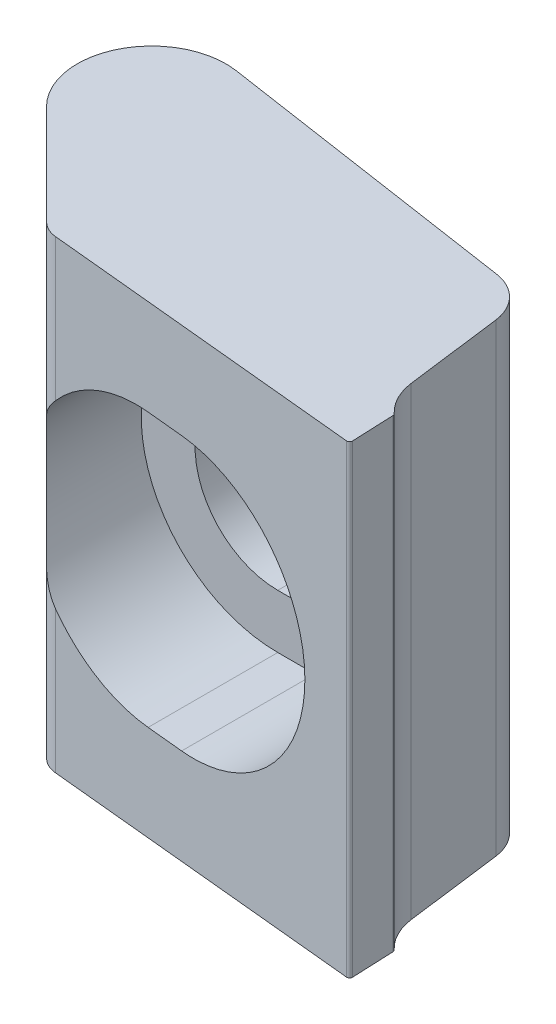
ISO-10303-21;
HEADER;
FILE_DESCRIPTION(('STEP AP214'),'2;1');
FILE_NAME('part.step','',(''),(''),'','','');
FILE_SCHEMA(('AUTOMOTIVE_DESIGN { 1 0 10303 214 1 1 1 1 }'));
ENDSEC;
DATA;
#1=APPLICATION_CONTEXT('core data for automotive mechanical design processes');
#2=APPLICATION_PROTOCOL_DEFINITION('international standard','automotive_design',2000,#1);
#3=PRODUCT_CONTEXT('',#1,'mechanical');
#4=PRODUCT('Part','Part','',(#3));
#5=PRODUCT_RELATED_PRODUCT_CATEGORY('part','',(#4));
#6=PRODUCT_DEFINITION_FORMATION('','',#4);
#7=PRODUCT_DEFINITION_CONTEXT('part definition',#1,'design');
#8=PRODUCT_DEFINITION('design','',#6,#7);
#9=PRODUCT_DEFINITION_SHAPE('','',#8);
#10=(LENGTH_UNIT() NAMED_UNIT(*) SI_UNIT(.MILLI.,.METRE.));
#11=(NAMED_UNIT(*) PLANE_ANGLE_UNIT() SI_UNIT($,.RADIAN.));
#12=(NAMED_UNIT(*) SI_UNIT($,.STERADIAN.) SOLID_ANGLE_UNIT());
#13=UNCERTAINTY_MEASURE_WITH_UNIT(LENGTH_MEASURE(1.E-05),#10,'distance_accuracy_value','');
#14=(GEOMETRIC_REPRESENTATION_CONTEXT(3) GLOBAL_UNCERTAINTY_ASSIGNED_CONTEXT((#13)) GLOBAL_UNIT_ASSIGNED_CONTEXT((#10,
#11,#12)) REPRESENTATION_CONTEXT('',''));
#15=CARTESIAN_POINT('',(0.,0.,0.));
#16=DIRECTION('',(0.,0.,1.));
#17=DIRECTION('',(1.,0.,0.));
#18=AXIS2_PLACEMENT_3D('',#15,#16,#17);
#19=CARTESIAN_POINT('',(-3.74531324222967,6.35,5.6642));
#20=DIRECTION('',(0.,-1.,0.));
#21=DIRECTION('',(1.,0.,0.));
#22=AXIS2_PLACEMENT_3D('',#19,#20,#21);
#23=CYLINDRICAL_SURFACE('',#22,0.762);
#24=DIRECTION('',(0.,-1.,0.));
#25=VECTOR('',#24,1.);
#26=CARTESIAN_POINT('',(-4.28385165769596,6.35,6.20329217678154));
#27=LINE('',#26,#25);
#28=CARTESIAN_POINT('',(-4.28385165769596,6.35,6.20329217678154));
#29=VERTEX_POINT('',#28);
#30=CARTESIAN_POINT('',(-4.28385165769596,1.80621371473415,6.20329217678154));
#31=VERTEX_POINT('',#30);
#32=EDGE_CURVE('E314',#29,#31,#27,.T.);
#33=ORIENTED_EDGE('',*,*,#32,.T.);
#34=CARTESIAN_POINT('',(-4.28385165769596,1.80621371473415,6.20329217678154));
#35=CARTESIAN_POINT('',(-4.25857898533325,1.85195880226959,6.22847677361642));
#36=CARTESIAN_POINT('',(-4.23186668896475,1.89799930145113,6.25167891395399));
#37=CARTESIAN_POINT('',(-4.17557276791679,1.99029356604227,6.29410764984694));
#38=CARTESIAN_POINT('',(-4.14598590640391,2.0365475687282,6.31332678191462));
#39=CARTESIAN_POINT('',(-4.08466603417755,2.12779689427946,6.34734160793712));
#40=CARTESIAN_POINT('',(-4.05298773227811,2.17279889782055,6.36221802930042));
#41=CARTESIAN_POINT('',(-3.98707838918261,2.26208455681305,6.38769246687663));
#42=CARTESIAN_POINT('',(-3.95285034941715,2.3063689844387,6.39829542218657));
#43=CARTESIAN_POINT('',(-3.90155545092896,2.36969807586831,6.41018736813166));
#44=CARTESIAN_POINT('',(-3.88544920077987,2.38917667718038,6.41338642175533));
#45=CARTESIAN_POINT('',(-3.85270020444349,2.42797068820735,6.41877832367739));
#46=CARTESIAN_POINT('',(-3.83605537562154,2.44728497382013,6.42096659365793));
#47=CARTESIAN_POINT('',(-3.81918632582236,2.46645674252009,6.42261068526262));
#48=B_SPLINE_CURVE_WITH_KNOTS('',3,(#34,#35,#36,#37,#38,#39,#40,#41,#42,#43,#44,#45,#46,#47),
.UNSPECIFIED.,.F.,.F.,(4,2,2,2,2,2,4),(0.,0.173988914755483,0.348300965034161,0.519129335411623,
0.689759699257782,0.766167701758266,0.84291847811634),.UNSPECIFIED.);
#49=CARTESIAN_POINT('',(-3.81918632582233,2.46645674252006,6.42261068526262));
#50=VERTEX_POINT('',#49);
#51=EDGE_CURVE('E212',#31,#50,#48,.T.);
#52=ORIENTED_EDGE('',*,*,#51,.T.);
#53=DIRECTION('',(0.,-1.,0.));
#54=VECTOR('',#53,1.);
#55=CARTESIAN_POINT('',(-3.81918632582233,6.35,6.42261068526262));
#56=LINE('',#55,#54);
#57=CARTESIAN_POINT('',(-3.81918632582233,6.35,6.42261068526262));
#58=VERTEX_POINT('',#57);
#59=EDGE_CURVE('E310',#58,#50,#56,.T.);
#60=ORIENTED_EDGE('',*,*,#59,.F.);
#61=CARTESIAN_POINT('',(-3.74531324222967,6.35,5.6642));
#62=DIRECTION('',(0.,1.,0.));
#63=DIRECTION('',(-1.,0.,0.));
#64=AXIS2_PLACEMENT_3D('',#61,#62,#63);
#65=CIRCLE('',#64,0.762);
#66=EDGE_CURVE('E292',#29,#58,#65,.T.);
#67=ORIENTED_EDGE('',*,*,#66,.F.);
#68=EDGE_LOOP('',(#33,#52,#60,#67));
#69=FACE_BOUND('',#68,.T.);
#70=ADVANCED_FACE('F14',(#69),#23,.T.);
#71=CARTESIAN_POINT('',(4.95448975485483,6.35,6.04505085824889));
#72=DIRECTION('',(0.,-1.,0.));
#73=DIRECTION('',(1.,0.,0.));
#74=AXIS2_PLACEMENT_3D('',#71,#72,#73);
#75=CYLINDRICAL_SURFACE('',#74,0.0762);
#76=CARTESIAN_POINT('',(4.95448975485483,-6.35,6.04505085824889));
#77=DIRECTION('',(0.,1.,0.));
#78=DIRECTION('',(-1.,0.,0.));
#79=AXIS2_PLACEMENT_3D('',#76,#77,#78);
#80=CIRCLE('',#79,0.0762);
#81=CARTESIAN_POINT('',(5.03062085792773,-6.35,6.0418112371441));
#82=VERTEX_POINT('',#81);
#83=CARTESIAN_POINT('',(5.00659435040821,-6.35,5.98944913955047));
#84=VERTEX_POINT('',#83);
#85=EDGE_CURVE('E252',#82,#84,#80,.T.);
#86=ORIENTED_EDGE('',*,*,#85,.T.);
#87=DIRECTION('',(0.,-1.,0.));
#88=VECTOR('',#87,1.);
#89=CARTESIAN_POINT('',(5.00659435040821,6.35,5.98944913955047));
#90=LINE('',#89,#88);
#91=CARTESIAN_POINT('',(5.00659435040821,6.35,5.98944913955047));
#92=VERTEX_POINT('',#91);
#93=EDGE_CURVE('E332',#92,#84,#90,.T.);
#94=ORIENTED_EDGE('',*,*,#93,.F.);
#95=CARTESIAN_POINT('',(4.95448975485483,6.35,6.04505085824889));
#96=DIRECTION('',(0.,1.,0.));
#97=DIRECTION('',(-1.,0.,0.));
#98=AXIS2_PLACEMENT_3D('',#95,#96,#97);
#99=CIRCLE('',#98,0.0762);
#100=CARTESIAN_POINT('',(5.03062085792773,6.35,6.0418112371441));
#101=VERTEX_POINT('',#100);
#102=EDGE_CURVE('E277',#101,#92,#99,.T.);
#103=ORIENTED_EDGE('',*,*,#102,.F.);
#104=DIRECTION('',(0.,-1.,0.));
#105=VECTOR('',#104,1.);
#106=CARTESIAN_POINT('',(5.03062085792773,6.35,6.0418112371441));
#107=LINE('',#106,#105);
#108=EDGE_CURVE('E300',#101,#82,#107,.T.);
#109=ORIENTED_EDGE('',*,*,#108,.T.);
#110=EDGE_LOOP('',(#86,#94,#103,#109));
#111=FACE_BOUND('',#110,.T.);
#112=ADVANCED_FACE('F16',(#111),#75,.T.);
#113=CARTESIAN_POINT('',(6.09210675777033,6.35,4.83108));
#114=DIRECTION('',(0.,-1.,0.));
#115=DIRECTION('',(1.,0.,0.));
#116=AXIS2_PLACEMENT_3D('',#113,#114,#115);
#117=CYLINDRICAL_SURFACE('',#116,1.5875);
#118=CARTESIAN_POINT('',(6.09210675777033,-6.35,4.83108));
#119=DIRECTION('',(0.,-1.,0.));
#120=DIRECTION('',(-1.,0.,0.));
#121=AXIS2_PLACEMENT_3D('',#118,#119,#120);
#122=CIRCLE('',#121,1.5875);
#123=CARTESIAN_POINT('',(4.51768942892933,-6.35,5.03446712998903));
#124=VERTEX_POINT('',#123);
#125=EDGE_CURVE('E255',#84,#124,#122,.T.);
#126=ORIENTED_EDGE('',*,*,#125,.T.);
#127=DIRECTION('',(0.,-1.,0.));
#128=VECTOR('',#127,1.);
#129=CARTESIAN_POINT('',(4.51768942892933,6.35,5.03446712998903));
#130=LINE('',#129,#128);
#131=CARTESIAN_POINT('',(4.51768942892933,6.35,5.03446712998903));
#132=VERTEX_POINT('',#131);
#133=EDGE_CURVE('E329',#132,#124,#130,.T.);
#134=ORIENTED_EDGE('',*,*,#133,.F.);
#135=CARTESIAN_POINT('',(6.09210675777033,6.35,4.83108));
#136=DIRECTION('',(0.,-1.,0.));
#137=DIRECTION('',(-1.,0.,0.));
#138=AXIS2_PLACEMENT_3D('',#135,#136,#137);
#139=CIRCLE('',#138,1.5875);
#140=EDGE_CURVE('E280',#92,#132,#139,.T.);
#141=ORIENTED_EDGE('',*,*,#140,.F.);
#142=ORIENTED_EDGE('',*,*,#93,.T.);
#143=EDGE_LOOP('',(#126,#134,#141,#142));
#144=FACE_BOUND('',#143,.T.);
#145=ADVANCED_FACE('F403',(#144),#117,.F.);
#146=CARTESIAN_POINT('',(4.51768942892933,6.35,5.03446712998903));
#147=DIRECTION('',(-0.991758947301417,0.,0.128117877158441));
#148=DIRECTION('',(0.128117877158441,0.,0.991758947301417));
#149=AXIS2_PLACEMENT_3D('',#146,#147,#148);
#150=PLANE('',#149);
#151=DIRECTION('',(-0.128117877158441,0.,-0.991758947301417));
#152=VECTOR('',#151,1.);
#153=CARTESIAN_POINT('',(4.51768942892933,-6.35,5.03446712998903));
#154=LINE('',#153,#152);
#155=CARTESIAN_POINT('',(4.17410062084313,-6.35,2.37475029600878));
#156=VERTEX_POINT('',#155);
#157=EDGE_CURVE('E257',#124,#156,#154,.T.);
#158=ORIENTED_EDGE('',*,*,#157,.T.);
#159=DIRECTION('',(0.,-1.,0.));
#160=VECTOR('',#159,1.);
#161=CARTESIAN_POINT('',(4.17410062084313,6.35,2.37475029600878));
#162=LINE('',#161,#160);
#163=CARTESIAN_POINT('',(4.17410062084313,6.35,2.37475029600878));
#164=VERTEX_POINT('',#163);
#165=EDGE_CURVE('E326',#164,#156,#162,.T.);
#166=ORIENTED_EDGE('',*,*,#165,.F.);
#167=DIRECTION('',(-0.128117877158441,0.,-0.991758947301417));
#168=VECTOR('',#167,1.);
#169=CARTESIAN_POINT('',(4.51768942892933,6.35,5.03446712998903));
#170=LINE('',#169,#168);
#171=EDGE_CURVE('E282',#132,#164,#170,.T.);
#172=ORIENTED_EDGE('',*,*,#171,.F.);
#173=ORIENTED_EDGE('',*,*,#133,.T.);
#174=EDGE_LOOP('',(#158,#166,#172,#173));
#175=FACE_BOUND('',#174,.T.);
#176=ADVANCED_FACE('F399',(#175),#150,.F.);
#177=CARTESIAN_POINT('',(2.91456675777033,6.35,2.53746));
#178=DIRECTION('',(0.,-1.,0.));
#179=DIRECTION('',(1.,0.,0.));
#180=AXIS2_PLACEMENT_3D('',#177,#178,#179);
#181=CYLINDRICAL_SURFACE('',#180,1.27);
#182=CARTESIAN_POINT('',(2.91456675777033,-6.35,2.53746));
#183=DIRECTION('',(0.,1.,0.));
#184=DIRECTION('',(-1.,0.,0.));
#185=AXIS2_PLACEMENT_3D('',#182,#183,#184);
#186=CIRCLE('',#185,1.27);
#187=CARTESIAN_POINT('',(3.10312886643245,-6.35,1.28153630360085));
#188=VERTEX_POINT('',#187);
#189=EDGE_CURVE('E259',#156,#188,#186,.T.);
#190=ORIENTED_EDGE('',*,*,#189,.T.);
#191=DIRECTION('',(0.,-1.,0.));
#192=VECTOR('',#191,1.);
#193=CARTESIAN_POINT('',(3.10312886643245,6.35,1.28153630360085));
#194=LINE('',#193,#192);
#195=CARTESIAN_POINT('',(3.10312886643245,6.35,1.28153630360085));
#196=VERTEX_POINT('',#195);
#197=EDGE_CURVE('E323',#196,#188,#194,.T.);
#198=ORIENTED_EDGE('',*,*,#197,.F.);
#199=CARTESIAN_POINT('',(2.91456675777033,6.35,2.53746));
#200=DIRECTION('',(0.,1.,0.));
#201=DIRECTION('',(-1.,0.,0.));
#202=AXIS2_PLACEMENT_3D('',#199,#200,#201);
#203=CIRCLE('',#202,1.27);
#204=EDGE_CURVE('E284',#164,#196,#203,.T.);
#205=ORIENTED_EDGE('',*,*,#204,.F.);
#206=ORIENTED_EDGE('',*,*,#165,.T.);
#207=EDGE_LOOP('',(#190,#198,#205,#206));
#208=FACE_BOUND('',#207,.T.);
#209=ADVANCED_FACE('F395',(#208),#181,.T.);
#210=CARTESIAN_POINT('',(-5.28257386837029,6.35,0.0225220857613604));
#211=DIRECTION('',(-0.14847410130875,0.,0.988916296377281));
#212=DIRECTION('',(0.988916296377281,0.,0.14847410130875));
#213=AXIS2_PLACEMENT_3D('',#210,#211,#212);
#214=PLANE('',#213);
#215=DIRECTION('',(-0.988916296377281,0.,-0.14847410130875));
#216=VECTOR('',#215,1.);
#217=CARTESIAN_POINT('',(-5.28257386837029,2.2606,0.0225220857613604));
#218=LINE('',#217,#216);
#219=CARTESIAN_POINT('',(0.,2.2606,0.81563815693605));
#220=VERTEX_POINT('',#219);
#221=CARTESIAN_POINT('',(-1.016,2.2606,0.663097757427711));
#222=VERTEX_POINT('',#221);
#223=EDGE_CURVE('E190',#220,#222,#218,.T.);
#224=ORIENTED_EDGE('',*,*,#223,.T.);
#225=CARTESIAN_POINT('',(-1.016,0.,0.663097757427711));
#226=DIRECTION('',(-0.14847410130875,0.,0.988916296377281));
#227=DIRECTION('',(0.988916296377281,0.,0.14847410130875));
#228=AXIS2_PLACEMENT_3D('',#225,#226,#227);
#229=ELLIPSE('',#228,2.28593664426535,2.2606);
#230=CARTESIAN_POINT('',(-1.016,-2.2606,0.663097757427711));
#231=VERTEX_POINT('',#230);
#232=EDGE_CURVE('E193',#222,#231,#229,.T.);
#233=ORIENTED_EDGE('',*,*,#232,.T.);
#234=DIRECTION('',(0.988916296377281,0.,0.14847410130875));
#235=VECTOR('',#234,1.);
#236=CARTESIAN_POINT('',(-5.28257386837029,-2.2606,0.0225220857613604));
#237=LINE('',#236,#235);
#238=CARTESIAN_POINT('',(0.,-2.2606,0.81563815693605));
#239=VERTEX_POINT('',#238);
#240=EDGE_CURVE('E185',#231,#239,#237,.T.);
#241=ORIENTED_EDGE('',*,*,#240,.T.);
#242=CARTESIAN_POINT('',(0.,0.,0.81563815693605));
#243=DIRECTION('',(-0.14847410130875,0.,0.988916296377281));
#244=DIRECTION('',(0.988916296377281,0.,0.14847410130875));
#245=AXIS2_PLACEMENT_3D('',#242,#243,#244);
#246=ELLIPSE('',#245,2.28593664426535,2.2606);
#247=EDGE_CURVE('E165',#239,#220,#246,.T.);
#248=ORIENTED_EDGE('',*,*,#247,.T.);
#249=EDGE_LOOP('',(#224,#233,#241,#248));
#250=FACE_BOUND('',#249,.T.);
#251=DIRECTION('',(-0.988916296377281,0.,-0.14847410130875));
#252=VECTOR('',#251,1.);
#253=CARTESIAN_POINT('',(-5.28257386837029,-6.35,0.0225220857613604));
#254=LINE('',#253,#252);
#255=CARTESIAN_POINT('',(-5.28257386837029,-6.35,0.0225220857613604));
#256=VERTEX_POINT('',#255);
#257=EDGE_CURVE('E261',#188,#256,#254,.T.);
#258=ORIENTED_EDGE('',*,*,#257,.T.);
#259=DIRECTION('',(0.,-1.,0.));
#260=VECTOR('',#259,1.);
#261=CARTESIAN_POINT('',(-5.28257386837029,6.35,0.0225220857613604));
#262=LINE('',#261,#260);
#263=CARTESIAN_POINT('',(-5.28257386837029,6.35,0.0225220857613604));
#264=VERTEX_POINT('',#263);
#265=EDGE_CURVE('E320',#264,#256,#262,.T.);
#266=ORIENTED_EDGE('',*,*,#265,.F.);
#267=DIRECTION('',(-0.988916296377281,0.,-0.14847410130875));
#268=VECTOR('',#267,1.);
#269=CARTESIAN_POINT('',(-5.28257386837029,6.35,0.0225220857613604));
#270=LINE('',#269,#268);
#271=EDGE_CURVE('E286',#196,#264,#270,.T.);
#272=ORIENTED_EDGE('',*,*,#271,.F.);
#273=ORIENTED_EDGE('',*,*,#197,.T.);
#274=EDGE_LOOP('',(#258,#266,#272,#273));
#275=FACE_BOUND('',#274,.T.);
#276=ADVANCED_FACE('F391',(#250,#275),#214,.F.);
#277=CARTESIAN_POINT('',(-5.58427324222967,6.35,2.032));
#278=DIRECTION('',(0.,-1.,0.));
#279=DIRECTION('',(1.,0.,0.));
#280=AXIS2_PLACEMENT_3D('',#277,#278,#279);
#281=CYLINDRICAL_SURFACE('',#280,2.032);
#282=CARTESIAN_POINT('',(-5.58427324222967,-6.35,2.032));
#283=DIRECTION('',(0.,1.,0.));
#284=DIRECTION('',(-1.,0.,0.));
#285=AXIS2_PLACEMENT_3D('',#282,#283,#284);
#286=CIRCLE('',#285,2.032);
#287=CARTESIAN_POINT('',(-7.02037568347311,-6.35,3.46957913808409));
#288=VERTEX_POINT('',#287);
#289=EDGE_CURVE('E263',#256,#288,#286,.T.);
#290=ORIENTED_EDGE('',*,*,#289,.T.);
#291=DIRECTION('',(0.,-1.,0.));
#292=VECTOR('',#291,1.);
#293=CARTESIAN_POINT('',(-7.02037568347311,6.35,3.46957913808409));
#294=LINE('',#293,#292);
#295=CARTESIAN_POINT('',(-7.02037568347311,6.35,3.46957913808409));
#296=VERTEX_POINT('',#295);
#297=EDGE_CURVE('E317',#296,#288,#294,.T.);
#298=ORIENTED_EDGE('',*,*,#297,.F.);
#299=CARTESIAN_POINT('',(-5.58427324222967,6.35,2.032));
#300=DIRECTION('',(0.,1.,0.));
#301=DIRECTION('',(-1.,0.,0.));
#302=AXIS2_PLACEMENT_3D('',#299,#300,#301);
#303=CIRCLE('',#302,2.032);
#304=EDGE_CURVE('E288',#264,#296,#303,.T.);
#305=ORIENTED_EDGE('',*,*,#304,.F.);
#306=ORIENTED_EDGE('',*,*,#265,.T.);
#307=EDGE_LOOP('',(#290,#298,#305,#306));
#308=FACE_BOUND('',#307,.T.);
#309=ADVANCED_FACE('F386',(#308),#281,.T.);
#310=CARTESIAN_POINT('',(-4.28385165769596,6.35,6.20329217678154));
#311=DIRECTION('',(0.706743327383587,0.,-0.707470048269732));
#312=DIRECTION('',(-0.707470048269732,0.,-0.706743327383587));
#313=AXIS2_PLACEMENT_3D('',#310,#311,#312);
#314=PLANE('',#313);
#315=CARTESIAN_POINT('',(-4.28385165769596,-1.80621371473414,6.20329217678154));
#316=VERTEX_POINT('',#315);
#317=CARTESIAN_POINT('',(-4.28385165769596,-6.35,6.20329217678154));
#318=VERTEX_POINT('',#317);
#319=EDGE_CURVE('E313',#316,#318,#27,.T.);
#320=ORIENTED_EDGE('',*,*,#319,.F.);
#321=CARTESIAN_POINT('',(-1.016,0.,9.46778706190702));
#322=DIRECTION('',(0.706743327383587,0.,-0.707470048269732));
#323=DIRECTION('',(0.707470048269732,0.,0.706743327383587));
#324=AXIS2_PLACEMENT_3D('',#321,#322,#323);
#325=ELLIPSE('',#324,5.27767925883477,3.7338);
#326=EDGE_CURVE('E228',#316,#31,#325,.T.);
#327=ORIENTED_EDGE('',*,*,#326,.T.);
#328=ORIENTED_EDGE('',*,*,#32,.F.);
#329=DIRECTION('',(0.707470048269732,0.,0.706743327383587));
#330=VECTOR('',#329,1.);
#331=CARTESIAN_POINT('',(-4.28385165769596,6.35,6.20329217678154));
#332=LINE('',#331,#330);
#333=EDGE_CURVE('E290',#296,#29,#332,.T.);
#334=ORIENTED_EDGE('',*,*,#333,.F.);
#335=ORIENTED_EDGE('',*,*,#297,.T.);
#336=DIRECTION('',(0.707470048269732,0.,0.706743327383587));
#337=VECTOR('',#336,1.);
#338=CARTESIAN_POINT('',(-4.28385165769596,-6.35,6.20329217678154));
#339=LINE('',#338,#337);
#340=EDGE_CURVE('E265',#288,#318,#339,.T.);
#341=ORIENTED_EDGE('',*,*,#340,.T.);
#342=EDGE_LOOP('',(#320,#327,#328,#334,#335,#341));
#343=FACE_BOUND('',#342,.T.);
#344=ADVANCED_FACE('F356',(#343),#314,.F.);
#345=CARTESIAN_POINT('',(-3.81918632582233,-2.46645674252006,6.42261068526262));
#346=VERTEX_POINT('',#345);
#347=CARTESIAN_POINT('',(-3.81918632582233,-6.35,6.42261068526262));
#348=VERTEX_POINT('',#347);
#349=EDGE_CURVE('E309',#346,#348,#56,.T.);
#350=ORIENTED_EDGE('',*,*,#349,.F.);
#351=CARTESIAN_POINT('',(-3.81918632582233,-2.46645674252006,6.42261068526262));
#352=CARTESIAN_POINT('',(-3.85286461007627,-2.42819103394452,6.41931082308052));
#353=CARTESIAN_POINT('',(-3.88563489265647,-2.38935655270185,6.41387476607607));
#354=CARTESIAN_POINT('',(-3.94921411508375,-2.31085548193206,6.39914196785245));
#355=CARTESIAN_POINT('',(-3.9800241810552,-2.27118938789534,6.38984746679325));
#356=CARTESIAN_POINT('',(-4.03910741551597,-2.19191552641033,6.36797851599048));
#357=CARTESIAN_POINT('',(-4.06741292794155,-2.15231670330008,6.35545810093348));
#358=CARTESIAN_POINT('',(-4.12196567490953,-2.07281507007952,6.3273131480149));
#359=CARTESIAN_POINT('',(-4.14821319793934,-2.03291230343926,6.31168904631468));
#360=CARTESIAN_POINT('',(-4.19305079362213,-1.96187761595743,6.28124106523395));
#361=CARTESIAN_POINT('',(-4.21205257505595,-1.93075315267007,6.26700131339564));
#362=CARTESIAN_POINT('',(-4.24887982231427,-1.86844124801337,6.23659331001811));
#363=CARTESIAN_POINT('',(-4.26669716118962,-1.83725463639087,6.22041352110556));
#364=CARTESIAN_POINT('',(-4.28385165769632,-1.80621371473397,6.20329217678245));
#365=B_SPLINE_CURVE_WITH_KNOTS('',3,(#351,#352,#353,#354,#355,#356,#357,#358,#359,#360,#361,
#362,#363,#364),.UNSPECIFIED.,.F.,.F.,(4,2,2,2,2,2,4),(0.,0.153140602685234,0.306192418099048,
0.456830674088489,0.607447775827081,0.724830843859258,0.842950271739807),.UNSPECIFIED.);
#366=EDGE_CURVE('E245',#346,#316,#365,.T.);
#367=ORIENTED_EDGE('',*,*,#366,.T.);
#368=ORIENTED_EDGE('',*,*,#319,.T.);
#369=CARTESIAN_POINT('',(-3.74531324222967,-6.35,5.6642));
#370=DIRECTION('',(0.,1.,0.));
#371=DIRECTION('',(-1.,0.,0.));
#372=AXIS2_PLACEMENT_3D('',#369,#370,#371);
#373=CIRCLE('',#372,0.762);
#374=EDGE_CURVE('E268',#318,#348,#373,.T.);
#375=ORIENTED_EDGE('',*,*,#374,.T.);
#376=EDGE_LOOP('',(#350,#367,#368,#375));
#377=FACE_BOUND('',#376,.T.);
#378=ADVANCED_FACE('F230',(#377),#23,.T.);
#379=CARTESIAN_POINT('',(4.99648158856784,6.35,7.2813018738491));
#380=DIRECTION('',(0.0969463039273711,0.,-0.995289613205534));
#381=DIRECTION('',(-0.995289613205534,0.,-0.0969463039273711));
#382=AXIS2_PLACEMENT_3D('',#379,#380,#381);
#383=PLANE('',#382);
#384=DIRECTION('',(-0.995289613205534,0.,-0.0969463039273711));
#385=VECTOR('',#384,1.);
#386=CARTESIAN_POINT('',(4.99648158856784,-3.7338,7.2813018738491));
#387=LINE('',#386,#385);
#388=CARTESIAN_POINT('',(0.,-3.7338,6.79461898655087));
#389=VERTEX_POINT('',#388);
#390=CARTESIAN_POINT('',(-1.016,-3.7338,6.6956553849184));
#391=VERTEX_POINT('',#390);
#392=EDGE_CURVE('E18',#389,#391,#387,.T.);
#393=ORIENTED_EDGE('',*,*,#392,.T.);
#394=CARTESIAN_POINT('',(-1.016,0.,6.6956553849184));
#395=DIRECTION('',(0.0969463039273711,0.,-0.995289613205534));
#396=DIRECTION('',(0.995289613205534,0.,0.0969463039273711));
#397=AXIS2_PLACEMENT_3D('',#394,#395,#396);
#398=ELLIPSE('',#397,3.75147087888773,3.7338);
#399=EDGE_CURVE('E9',#391,#346,#398,.T.);
#400=ORIENTED_EDGE('',*,*,#399,.T.);
#401=ORIENTED_EDGE('',*,*,#349,.T.);
#402=DIRECTION('',(0.995289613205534,0.,0.0969463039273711));
#403=VECTOR('',#402,1.);
#404=CARTESIAN_POINT('',(4.99648158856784,-6.35,7.2813018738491));
#405=LINE('',#404,#403);
#406=CARTESIAN_POINT('',(4.99648158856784,-6.35,7.2813018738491));
#407=VERTEX_POINT('',#406);
#408=EDGE_CURVE('E271',#348,#407,#405,.T.);
#409=ORIENTED_EDGE('',*,*,#408,.T.);
#410=DIRECTION('',(0.,-1.,0.));
#411=VECTOR('',#410,1.);
#412=CARTESIAN_POINT('',(4.99648158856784,6.35,7.2813018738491));
#413=LINE('',#412,#411);
#414=CARTESIAN_POINT('',(4.99648158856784,6.35,7.2813018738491));
#415=VERTEX_POINT('',#414);
#416=EDGE_CURVE('E306',#415,#407,#413,.T.);
#417=ORIENTED_EDGE('',*,*,#416,.F.);
#418=DIRECTION('',(0.995289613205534,0.,0.0969463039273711));
#419=VECTOR('',#418,1.);
#420=CARTESIAN_POINT('',(4.99648158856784,6.35,7.2813018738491));
#421=LINE('',#420,#419);
#422=EDGE_CURVE('E294',#58,#415,#421,.T.);
#423=ORIENTED_EDGE('',*,*,#422,.F.);
#424=ORIENTED_EDGE('',*,*,#59,.T.);
#425=CARTESIAN_POINT('',(-1.016,3.7338,6.6956553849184));
#426=VERTEX_POINT('',#425);
#427=EDGE_CURVE('E24',#50,#426,#398,.T.);
#428=ORIENTED_EDGE('',*,*,#427,.T.);
#429=DIRECTION('',(0.995289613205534,0.,0.0969463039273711));
#430=VECTOR('',#429,1.);
#431=CARTESIAN_POINT('',(4.99648158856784,3.7338,7.2813018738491));
#432=LINE('',#431,#430);
#433=CARTESIAN_POINT('',(0.,3.7338,6.79461898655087));
#434=VERTEX_POINT('',#433);
#435=EDGE_CURVE('E335',#426,#434,#432,.T.);
#436=ORIENTED_EDGE('',*,*,#435,.T.);
#437=CARTESIAN_POINT('',(0.,0.,6.79461898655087));
#438=DIRECTION('',(0.0969463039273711,0.,-0.995289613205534));
#439=DIRECTION('',(0.995289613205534,0.,0.0969463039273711));
#440=AXIS2_PLACEMENT_3D('',#437,#438,#439);
#441=ELLIPSE('',#440,3.75147087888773,3.7338);
#442=EDGE_CURVE('E338',#434,#389,#441,.T.);
#443=ORIENTED_EDGE('',*,*,#442,.T.);
#444=EDGE_LOOP('',(#393,#400,#401,#409,#417,#423,#424,#428,#436,#443));
#445=FACE_BOUND('',#444,.T.);
#446=ADVANCED_FACE('F343',(#445),#383,.F.);
#447=CARTESIAN_POINT('',(5.0038688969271,6.35,7.20546080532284));
#448=DIRECTION('',(0.,-1.,0.));
#449=DIRECTION('',(1.,0.,0.));
#450=AXIS2_PLACEMENT_3D('',#447,#448,#449);
#451=CYLINDRICAL_SURFACE('',#450,0.0762);
#452=CARTESIAN_POINT('',(5.0038688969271,-6.35,7.20546080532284));
#453=DIRECTION('',(0.,1.,0.));
#454=DIRECTION('',(-1.,0.,0.));
#455=AXIS2_PLACEMENT_3D('',#452,#453,#454);
#456=CIRCLE('',#455,0.0762);
#457=CARTESIAN_POINT('',(5.08,-6.35,7.20222118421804));
#458=VERTEX_POINT('',#457);
#459=EDGE_CURVE('E273',#407,#458,#456,.T.);
#460=ORIENTED_EDGE('',*,*,#459,.T.);
#461=DIRECTION('',(0.,-1.,0.));
#462=VECTOR('',#461,1.);
#463=CARTESIAN_POINT('',(5.08,6.35,7.20222118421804));
#464=LINE('',#463,#462);
#465=CARTESIAN_POINT('',(5.08,6.35,7.20222118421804));
#466=VERTEX_POINT('',#465);
#467=EDGE_CURVE('E303',#466,#458,#464,.T.);
#468=ORIENTED_EDGE('',*,*,#467,.F.);
#469=CARTESIAN_POINT('',(5.0038688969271,6.35,7.20546080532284));
#470=DIRECTION('',(0.,1.,0.));
#471=DIRECTION('',(-1.,0.,0.));
#472=AXIS2_PLACEMENT_3D('',#469,#470,#471);
#473=CIRCLE('',#472,0.0762);
#474=EDGE_CURVE('E296',#415,#466,#473,.T.);
#475=ORIENTED_EDGE('',*,*,#474,.F.);
#476=ORIENTED_EDGE('',*,*,#416,.T.);
#477=EDGE_LOOP('',(#460,#468,#475,#476));
#478=FACE_BOUND('',#477,.T.);
#479=ADVANCED_FACE('F373',(#478),#451,.T.);
#480=CARTESIAN_POINT('',(5.08,6.35,7.20222118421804));
#481=DIRECTION('',(-0.999095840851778,0.,0.0425147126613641));
#482=DIRECTION('',(0.0425147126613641,0.,0.999095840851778));
#483=AXIS2_PLACEMENT_3D('',#480,#481,#482);
#484=PLANE('',#483);
#485=DIRECTION('',(-0.0425147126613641,0.,-0.999095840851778));
#486=VECTOR('',#485,1.);
#487=CARTESIAN_POINT('',(5.08,-6.35,7.20222118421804));
#488=LINE('',#487,#486);
#489=EDGE_CURVE('E275',#458,#82,#488,.T.);
#490=ORIENTED_EDGE('',*,*,#489,.T.);
#491=ORIENTED_EDGE('',*,*,#108,.F.);
#492=DIRECTION('',(-0.0425147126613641,0.,-0.999095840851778));
#493=VECTOR('',#492,1.);
#494=CARTESIAN_POINT('',(5.08,6.35,7.20222118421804));
#495=LINE('',#494,#493);
#496=EDGE_CURVE('E298',#466,#101,#495,.T.);
#497=ORIENTED_EDGE('',*,*,#496,.F.);
#498=ORIENTED_EDGE('',*,*,#467,.T.);
#499=EDGE_LOOP('',(#490,#491,#497,#498));
#500=FACE_BOUND('',#499,.T.);
#501=ADVANCED_FACE('F407',(#500),#484,.F.);
#502=CARTESIAN_POINT('',(4.95448975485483,6.35,6.04505085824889));
#503=DIRECTION('',(0.,1.,0.));
#504=DIRECTION('',(-1.,0.,0.));
#505=AXIS2_PLACEMENT_3D('',#502,#503,#504);
#506=PLANE('',#505);
#507=ORIENTED_EDGE('',*,*,#102,.T.);
#508=ORIENTED_EDGE('',*,*,#140,.T.);
#509=ORIENTED_EDGE('',*,*,#171,.T.);
#510=ORIENTED_EDGE('',*,*,#204,.T.);
#511=ORIENTED_EDGE('',*,*,#271,.T.);
#512=ORIENTED_EDGE('',*,*,#304,.T.);
#513=ORIENTED_EDGE('',*,*,#333,.T.);
#514=ORIENTED_EDGE('',*,*,#66,.T.);
#515=ORIENTED_EDGE('',*,*,#422,.T.);
#516=ORIENTED_EDGE('',*,*,#474,.T.);
#517=ORIENTED_EDGE('',*,*,#496,.T.);
#518=EDGE_LOOP('',(#507,#508,#509,#510,#511,#512,#513,#514,#515,#516,#517));
#519=FACE_BOUND('',#518,.T.);
#520=ADVANCED_FACE('F377',(#519),#506,.T.);
#521=CARTESIAN_POINT('',(4.95448975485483,-6.35,6.04505085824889));
#522=DIRECTION('',(0.,1.,0.));
#523=DIRECTION('',(-1.,0.,0.));
#524=AXIS2_PLACEMENT_3D('',#521,#522,#523);
#525=PLANE('',#524);
#526=ORIENTED_EDGE('',*,*,#85,.F.);
#527=ORIENTED_EDGE('',*,*,#489,.F.);
#528=ORIENTED_EDGE('',*,*,#459,.F.);
#529=ORIENTED_EDGE('',*,*,#408,.F.);
#530=ORIENTED_EDGE('',*,*,#374,.F.);
#531=ORIENTED_EDGE('',*,*,#340,.F.);
#532=ORIENTED_EDGE('',*,*,#289,.F.);
#533=ORIENTED_EDGE('',*,*,#257,.F.);
#534=ORIENTED_EDGE('',*,*,#189,.F.);
#535=ORIENTED_EDGE('',*,*,#157,.F.);
#536=ORIENTED_EDGE('',*,*,#125,.F.);
#537=EDGE_LOOP('',(#526,#527,#528,#529,#530,#531,#532,#533,#534,#535,#536));
#538=FACE_BOUND('',#537,.T.);
#539=ADVANCED_FACE('F366',(#538),#525,.F.);
#540=CARTESIAN_POINT('',(0.,0.,3.1496));
#541=DIRECTION('',(0.,0.,1.));
#542=DIRECTION('',(0.,1.,0.));
#543=AXIS2_PLACEMENT_3D('',#540,#541,#542);
#544=CYLINDRICAL_SURFACE('',#543,3.7338);
#545=DIRECTION('',(0.,0.,1.));
#546=VECTOR('',#545,1.);
#547=CARTESIAN_POINT('',(0.,3.7338,3.1496));
#548=LINE('',#547,#546);
#549=CARTESIAN_POINT('',(0.,3.7338,3.1496));
#550=VERTEX_POINT('',#549);
#551=EDGE_CURVE('E208',#550,#434,#548,.T.);
#552=ORIENTED_EDGE('',*,*,#551,.F.);
#553=CARTESIAN_POINT('',(0.,0.,3.1496));
#554=DIRECTION('',(0.,0.,1.));
#555=DIRECTION('',(0.,1.,0.));
#556=AXIS2_PLACEMENT_3D('',#553,#554,#555);
#557=CIRCLE('',#556,3.7338);
#558=CARTESIAN_POINT('',(0.,-3.7338,3.1496));
#559=VERTEX_POINT('',#558);
#560=EDGE_CURVE('E196',#559,#550,#557,.T.);
#561=ORIENTED_EDGE('',*,*,#560,.F.);
#562=DIRECTION('',(0.,0.,1.));
#563=VECTOR('',#562,1.);
#564=CARTESIAN_POINT('',(0.,-3.7338,3.1496));
#565=LINE('',#564,#563);
#566=EDGE_CURVE('E209',#559,#389,#565,.T.);
#567=ORIENTED_EDGE('',*,*,#566,.T.);
#568=ORIENTED_EDGE('',*,*,#442,.F.);
#569=EDGE_LOOP('',(#552,#561,#567,#568));
#570=FACE_BOUND('',#569,.T.);
#571=ADVANCED_FACE('F349',(#570),#544,.F.);
#572=CARTESIAN_POINT('',(0.,-3.7338,3.1496));
#573=DIRECTION('',(0.,-1.,0.));
#574=DIRECTION('',(1.,0.,0.));
#575=AXIS2_PLACEMENT_3D('',#572,#573,#574);
#576=PLANE('',#575);
#577=ORIENTED_EDGE('',*,*,#566,.F.);
#578=DIRECTION('',(1.,0.,0.));
#579=VECTOR('',#578,1.);
#580=CARTESIAN_POINT('',(0.,-3.7338,3.1496));
#581=LINE('',#580,#579);
#582=CARTESIAN_POINT('',(-1.016,-3.7338,3.1496));
#583=VERTEX_POINT('',#582);
#584=EDGE_CURVE('E205',#583,#559,#581,.T.);
#585=ORIENTED_EDGE('',*,*,#584,.F.);
#586=DIRECTION('',(0.,0.,1.));
#587=VECTOR('',#586,1.);
#588=CARTESIAN_POINT('',(-1.016,-3.7338,3.1496));
#589=LINE('',#588,#587);
#590=EDGE_CURVE('E213',#583,#391,#589,.T.);
#591=ORIENTED_EDGE('',*,*,#590,.T.);
#592=ORIENTED_EDGE('',*,*,#392,.F.);
#593=EDGE_LOOP('',(#577,#585,#591,#592));
#594=FACE_BOUND('',#593,.T.);
#595=ADVANCED_FACE('F240',(#594),#576,.F.);
#596=CARTESIAN_POINT('',(-1.016,0.,3.1496));
#597=DIRECTION('',(0.,0.,1.));
#598=DIRECTION('',(0.,1.,0.));
#599=AXIS2_PLACEMENT_3D('',#596,#597,#598);
#600=CYLINDRICAL_SURFACE('',#599,3.7338);
#601=ORIENTED_EDGE('',*,*,#590,.F.);
#602=CARTESIAN_POINT('',(-1.016,0.,3.1496));
#603=DIRECTION('',(0.,0.,1.));
#604=DIRECTION('',(0.,1.,0.));
#605=AXIS2_PLACEMENT_3D('',#602,#603,#604);
#606=CIRCLE('',#605,3.7338);
#607=CARTESIAN_POINT('',(-1.016,3.7338,3.1496));
#608=VERTEX_POINT('',#607);
#609=EDGE_CURVE('E202',#608,#583,#606,.T.);
#610=ORIENTED_EDGE('',*,*,#609,.F.);
#611=DIRECTION('',(0.,0.,1.));
#612=VECTOR('',#611,1.);
#613=CARTESIAN_POINT('',(-1.016,3.7338,3.1496));
#614=LINE('',#613,#612);
#615=EDGE_CURVE('E216',#608,#426,#614,.T.);
#616=ORIENTED_EDGE('',*,*,#615,.T.);
#617=ORIENTED_EDGE('',*,*,#427,.F.);
#618=ORIENTED_EDGE('',*,*,#51,.F.);
#619=ORIENTED_EDGE('',*,*,#326,.F.);
#620=ORIENTED_EDGE('',*,*,#366,.F.);
#621=ORIENTED_EDGE('',*,*,#399,.F.);
#622=EDGE_LOOP('',(#601,#610,#616,#617,#618,#619,#620,#621));
#623=FACE_BOUND('',#622,.T.);
#624=ADVANCED_FACE('F234',(#623),#600,.F.);
#625=CARTESIAN_POINT('',(-1.016,3.7338,3.1496));
#626=DIRECTION('',(0.,1.,0.));
#627=DIRECTION('',(-1.,0.,0.));
#628=AXIS2_PLACEMENT_3D('',#625,#626,#627);
#629=PLANE('',#628);
#630=ORIENTED_EDGE('',*,*,#615,.F.);
#631=DIRECTION('',(-1.,0.,0.));
#632=VECTOR('',#631,1.);
#633=CARTESIAN_POINT('',(-1.016,3.7338,3.1496));
#634=LINE('',#633,#632);
#635=EDGE_CURVE('E199',#550,#608,#634,.T.);
#636=ORIENTED_EDGE('',*,*,#635,.F.);
#637=ORIENTED_EDGE('',*,*,#551,.T.);
#638=ORIENTED_EDGE('',*,*,#435,.F.);
#639=EDGE_LOOP('',(#630,#636,#637,#638));
#640=FACE_BOUND('',#639,.T.);
#641=ADVANCED_FACE('F239',(#640),#629,.F.);
#642=CARTESIAN_POINT('',(0.,0.,3.1496));
#643=DIRECTION('',(0.,0.,1.));
#644=DIRECTION('',(0.,1.,0.));
#645=AXIS2_PLACEMENT_3D('',#642,#643,#644);
#646=PLANE('',#645);
#647=CARTESIAN_POINT('',(-1.016,0.,3.1496));
#648=DIRECTION('',(0.,0.,1.));
#649=DIRECTION('',(0.,1.,0.));
#650=AXIS2_PLACEMENT_3D('',#647,#648,#649);
#651=CIRCLE('',#650,2.2606);
#652=CARTESIAN_POINT('',(-1.016,2.2606,3.1496));
#653=VERTEX_POINT('',#652);
#654=CARTESIAN_POINT('',(-1.016,-2.2606,3.1496));
#655=VERTEX_POINT('',#654);
#656=EDGE_CURVE('E39',#653,#655,#651,.T.);
#657=ORIENTED_EDGE('',*,*,#656,.F.);
#658=DIRECTION('',(-1.,0.,0.));
#659=VECTOR('',#658,1.);
#660=CARTESIAN_POINT('',(-1.016,2.2606,3.1496));
#661=LINE('',#660,#659);
#662=CARTESIAN_POINT('',(0.,2.2606,3.1496));
#663=VERTEX_POINT('',#662);
#664=EDGE_CURVE('E178',#663,#653,#661,.T.);
#665=ORIENTED_EDGE('',*,*,#664,.F.);
#666=CARTESIAN_POINT('',(0.,0.,3.1496));
#667=DIRECTION('',(0.,0.,1.));
#668=DIRECTION('',(0.,1.,0.));
#669=AXIS2_PLACEMENT_3D('',#666,#667,#668);
#670=CIRCLE('',#669,2.2606);
#671=CARTESIAN_POINT('',(0.,-2.2606,3.1496));
#672=VERTEX_POINT('',#671);
#673=EDGE_CURVE('E162',#672,#663,#670,.T.);
#674=ORIENTED_EDGE('',*,*,#673,.F.);
#675=DIRECTION('',(1.,0.,0.));
#676=VECTOR('',#675,1.);
#677=CARTESIAN_POINT('',(-1.016,-2.2606,3.1496));
#678=LINE('',#677,#676);
#679=EDGE_CURVE('E171',#655,#672,#678,.T.);
#680=ORIENTED_EDGE('',*,*,#679,.F.);
#681=EDGE_LOOP('',(#657,#665,#674,#680));
#682=FACE_BOUND('',#681,.T.);
#683=ORIENTED_EDGE('',*,*,#560,.T.);
#684=ORIENTED_EDGE('',*,*,#635,.T.);
#685=ORIENTED_EDGE('',*,*,#609,.T.);
#686=ORIENTED_EDGE('',*,*,#584,.T.);
#687=EDGE_LOOP('',(#683,#684,#685,#686));
#688=FACE_BOUND('',#687,.T.);
#689=ADVANCED_FACE('F175',(#682,#688),#646,.T.);
#690=CARTESIAN_POINT('',(-1.016,0.,0.));
#691=DIRECTION('',(0.,0.,1.));
#692=DIRECTION('',(0.,1.,0.));
#693=AXIS2_PLACEMENT_3D('',#690,#691,#692);
#694=CYLINDRICAL_SURFACE('',#693,2.2606);
#695=DIRECTION('',(0.,0.,1.));
#696=VECTOR('',#695,1.);
#697=CARTESIAN_POINT('',(-1.016,2.2606,0.));
#698=LINE('',#697,#696);
#699=EDGE_CURVE('E183',#222,#653,#698,.T.);
#700=ORIENTED_EDGE('',*,*,#699,.T.);
#701=ORIENTED_EDGE('',*,*,#656,.T.);
#702=DIRECTION('',(0.,0.,1.));
#703=VECTOR('',#702,1.);
#704=CARTESIAN_POINT('',(-1.016,-2.2606,0.));
#705=LINE('',#704,#703);
#706=EDGE_CURVE('E168',#231,#655,#705,.T.);
#707=ORIENTED_EDGE('',*,*,#706,.F.);
#708=ORIENTED_EDGE('',*,*,#232,.F.);
#709=EDGE_LOOP('',(#700,#701,#707,#708));
#710=FACE_BOUND('',#709,.T.);
#711=ADVANCED_FACE('F537',(#710),#694,.F.);
#712=CARTESIAN_POINT('',(-1.016,2.2606,0.));
#713=DIRECTION('',(0.,1.,0.));
#714=DIRECTION('',(-1.,0.,0.));
#715=AXIS2_PLACEMENT_3D('',#712,#713,#714);
#716=PLANE('',#715);
#717=DIRECTION('',(0.,0.,1.));
#718=VECTOR('',#717,1.);
#719=CARTESIAN_POINT('',(0.,2.2606,0.));
#720=LINE('',#719,#718);
#721=EDGE_CURVE('E167',#220,#663,#720,.T.);
#722=ORIENTED_EDGE('',*,*,#721,.T.);
#723=ORIENTED_EDGE('',*,*,#664,.T.);
#724=ORIENTED_EDGE('',*,*,#699,.F.);
#725=ORIENTED_EDGE('',*,*,#223,.F.);
#726=EDGE_LOOP('',(#722,#723,#724,#725));
#727=FACE_BOUND('',#726,.T.);
#728=ADVANCED_FACE('F544',(#727),#716,.F.);
#729=CARTESIAN_POINT('',(0.,0.,0.));
#730=DIRECTION('',(0.,0.,1.));
#731=DIRECTION('',(0.,1.,0.));
#732=AXIS2_PLACEMENT_3D('',#729,#730,#731);
#733=CYLINDRICAL_SURFACE('',#732,2.2606);
#734=DIRECTION('',(0.,0.,1.));
#735=VECTOR('',#734,1.);
#736=CARTESIAN_POINT('',(0.,-2.2606,0.));
#737=LINE('',#736,#735);
#738=EDGE_CURVE('E31',#239,#672,#737,.T.);
#739=ORIENTED_EDGE('',*,*,#738,.T.);
#740=ORIENTED_EDGE('',*,*,#673,.T.);
#741=ORIENTED_EDGE('',*,*,#721,.F.);
#742=ORIENTED_EDGE('',*,*,#247,.F.);
#743=EDGE_LOOP('',(#739,#740,#741,#742));
#744=FACE_BOUND('',#743,.T.);
#745=ADVANCED_FACE('F159',(#744),#733,.F.);
#746=CARTESIAN_POINT('',(-1.016,-2.2606,0.));
#747=DIRECTION('',(0.,-1.,0.));
#748=DIRECTION('',(1.,0.,0.));
#749=AXIS2_PLACEMENT_3D('',#746,#747,#748);
#750=PLANE('',#749);
#751=ORIENTED_EDGE('',*,*,#706,.T.);
#752=ORIENTED_EDGE('',*,*,#679,.T.);
#753=ORIENTED_EDGE('',*,*,#738,.F.);
#754=ORIENTED_EDGE('',*,*,#240,.F.);
#755=EDGE_LOOP('',(#751,#752,#753,#754));
#756=FACE_BOUND('',#755,.T.);
#757=ADVANCED_FACE('F172',(#756),#750,.F.);
#758=CLOSED_SHELL('',(#70,#112,#145,#176,#209,#276,#309,#344,#378,#446,#479,#501,#520,#539,#571,
#595,#624,#641,#689,#711,#728,#745,#757));
#759=MANIFOLD_SOLID_BREP('B1',#758);
#760=ADVANCED_BREP_SHAPE_REPRESENTATION('',(#18,#759),#14);
#761=SHAPE_DEFINITION_REPRESENTATION(#9,#760);
ENDSEC;
END-ISO-10303-21;
